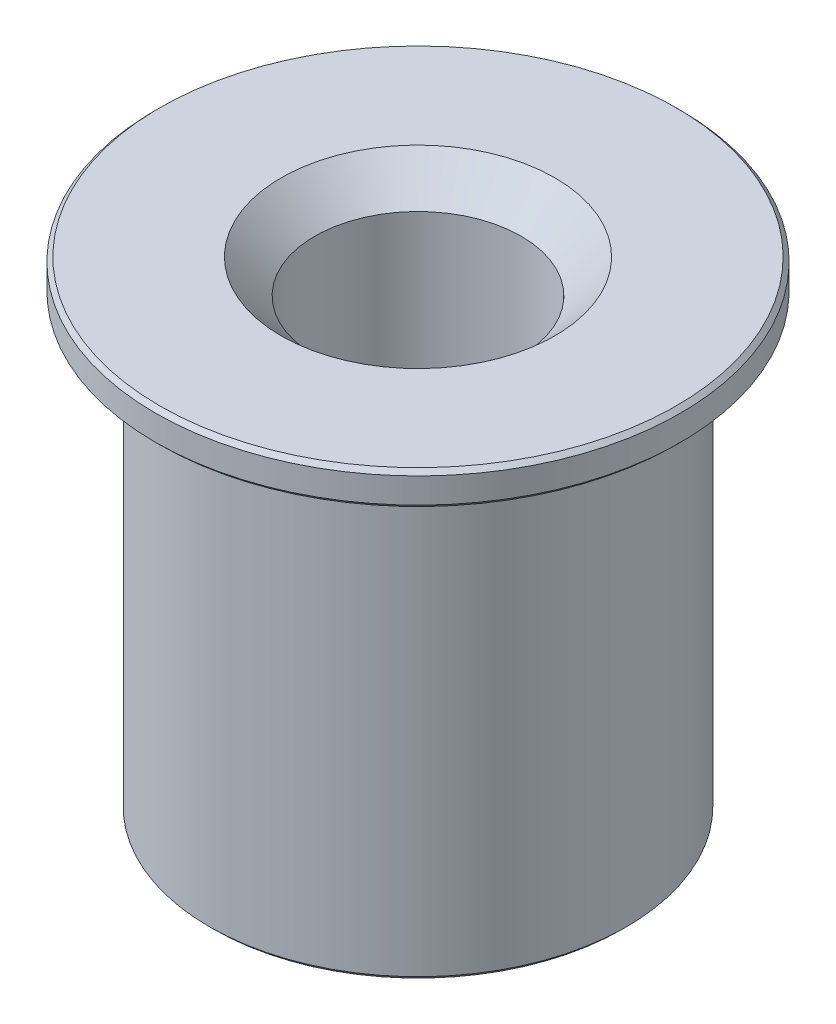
ISO-10303-21;
HEADER;
FILE_DESCRIPTION(('STEP AP214'),'2;1');
FILE_NAME('part.step','',(''),(''),'','','');
FILE_SCHEMA(('AUTOMOTIVE_DESIGN { 1 0 10303 214 1 1 1 1 }'));
ENDSEC;
DATA;
#1=APPLICATION_CONTEXT('core data for automotive mechanical design processes');
#2=APPLICATION_PROTOCOL_DEFINITION('international standard','automotive_design',2000,#1);
#3=PRODUCT_CONTEXT('',#1,'mechanical');
#4=PRODUCT('Part','Part','',(#3));
#5=PRODUCT_RELATED_PRODUCT_CATEGORY('part','',(#4));
#6=PRODUCT_DEFINITION_FORMATION('','',#4);
#7=PRODUCT_DEFINITION_CONTEXT('part definition',#1,'design');
#8=PRODUCT_DEFINITION('design','',#6,#7);
#9=PRODUCT_DEFINITION_SHAPE('','',#8);
#10=(LENGTH_UNIT() NAMED_UNIT(*) SI_UNIT(.MILLI.,.METRE.));
#11=(NAMED_UNIT(*) PLANE_ANGLE_UNIT() SI_UNIT($,.RADIAN.));
#12=(NAMED_UNIT(*) SI_UNIT($,.STERADIAN.) SOLID_ANGLE_UNIT());
#13=UNCERTAINTY_MEASURE_WITH_UNIT(LENGTH_MEASURE(1.E-05),#10,'distance_accuracy_value','');
#14=(GEOMETRIC_REPRESENTATION_CONTEXT(3) GLOBAL_UNCERTAINTY_ASSIGNED_CONTEXT((#13)) GLOBAL_UNIT_ASSIGNED_CONTEXT((#10,
#11,#12)) REPRESENTATION_CONTEXT('',''));
#15=CARTESIAN_POINT('',(0.,0.,0.));
#16=DIRECTION('',(0.,0.,1.));
#17=DIRECTION('',(1.,0.,0.));
#18=AXIS2_PLACEMENT_3D('',#15,#16,#17);
#19=CARTESIAN_POINT('',(0.,14.478,0.));
#20=DIRECTION('',(0.,-1.,0.));
#21=DIRECTION('',(0.,0.,-1.));
#22=AXIS2_PLACEMENT_3D('',#19,#20,#21);
#23=CYLINDRICAL_SURFACE('',#22,6.2865);
#24=CARTESIAN_POINT('',(0.,0.127000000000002,0.));
#25=DIRECTION('',(0.,1.,0.));
#26=DIRECTION('',(0.,0.,1.));
#27=AXIS2_PLACEMENT_3D('',#24,#25,#26);
#28=CIRCLE('',#27,6.2865);
#29=CARTESIAN_POINT('',(0.,0.127000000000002,6.2865));
#30=VERTEX_POINT('',#29);
#31=EDGE_CURVE('E46',#30,#30,#28,.T.);
#32=ORIENTED_EDGE('',*,*,#31,.T.);
#33=EDGE_LOOP('',(#32));
#34=FACE_BOUND('',#33,.T.);
#35=CARTESIAN_POINT('',(0.,13.335,0.));
#36=DIRECTION('',(0.,1.,0.));
#37=DIRECTION('',(0.,0.,1.));
#38=AXIS2_PLACEMENT_3D('',#35,#36,#37);
#39=CIRCLE('',#38,6.2865);
#40=CARTESIAN_POINT('',(0.,13.335,6.2865));
#41=VERTEX_POINT('',#40);
#42=EDGE_CURVE('E49',#41,#41,#39,.F.);
#43=ORIENTED_EDGE('',*,*,#42,.T.);
#44=EDGE_LOOP('',(#43));
#45=FACE_BOUND('',#44,.T.);
#46=ADVANCED_FACE('F24',(#34,#45),#23,.T.);
#47=CARTESIAN_POINT('',(0.,14.478,0.));
#48=DIRECTION('',(0.,1.,0.));
#49=DIRECTION('',(0.,0.,1.));
#50=AXIS2_PLACEMENT_3D('',#47,#48,#49);
#51=PLANE('',#50);
#52=CARTESIAN_POINT('',(0.,14.478,0.));
#53=DIRECTION('',(0.,1.,0.));
#54=DIRECTION('',(0.,0.,1.));
#55=AXIS2_PLACEMENT_3D('',#52,#53,#54);
#56=CIRCLE('',#55,7.7851);
#57=CARTESIAN_POINT('',(0.,14.478,7.7851));
#58=VERTEX_POINT('',#57);
#59=EDGE_CURVE('E10',#58,#58,#56,.T.);
#60=ORIENTED_EDGE('',*,*,#59,.T.);
#61=EDGE_LOOP('',(#60));
#62=FACE_BOUND('',#61,.T.);
#63=CARTESIAN_POINT('',(0.,14.478,0.));
#64=DIRECTION('',(0.,1.,0.));
#65=DIRECTION('',(0.,0.,1.));
#66=AXIS2_PLACEMENT_3D('',#63,#64,#65);
#67=CIRCLE('',#66,4.1275);
#68=CARTESIAN_POINT('',(0.,14.478,4.1275));
#69=VERTEX_POINT('',#68);
#70=EDGE_CURVE('E61',#69,#69,#67,.F.);
#71=ORIENTED_EDGE('',*,*,#70,.T.);
#72=EDGE_LOOP('',(#71));
#73=FACE_BOUND('',#72,.T.);
#74=ADVANCED_FACE('F88',(#62,#73),#51,.T.);
#75=CARTESIAN_POINT('',(0.,0.,0.));
#76=DIRECTION('',(0.,1.,0.));
#77=DIRECTION('',(0.,0.,1.));
#78=AXIS2_PLACEMENT_3D('',#75,#76,#77);
#79=PLANE('',#78);
#80=CARTESIAN_POINT('',(0.,0.,0.));
#81=DIRECTION('',(0.,1.,0.));
#82=DIRECTION('',(0.,0.,1.));
#83=AXIS2_PLACEMENT_3D('',#80,#81,#82);
#84=CIRCLE('',#83,3.2385);
#85=CARTESIAN_POINT('',(0.,0.,3.2385));
#86=VERTEX_POINT('',#85);
#87=EDGE_CURVE('E55',#86,#86,#84,.T.);
#88=ORIENTED_EDGE('',*,*,#87,.T.);
#89=EDGE_LOOP('',(#88));
#90=FACE_BOUND('',#89,.T.);
#91=CARTESIAN_POINT('',(0.,0.,0.));
#92=DIRECTION('',(0.,1.,0.));
#93=DIRECTION('',(0.,0.,1.));
#94=AXIS2_PLACEMENT_3D('',#91,#92,#93);
#95=CIRCLE('',#94,6.1595);
#96=CARTESIAN_POINT('',(0.,0.,6.1595));
#97=VERTEX_POINT('',#96);
#98=EDGE_CURVE('E58',#97,#97,#95,.F.);
#99=ORIENTED_EDGE('',*,*,#98,.T.);
#100=EDGE_LOOP('',(#99));
#101=FACE_BOUND('',#100,.T.);
#102=ADVANCED_FACE('F93',(#90,#101),#79,.F.);
#103=CARTESIAN_POINT('',(0.,14.478,0.));
#104=DIRECTION('',(0.,-1.,0.));
#105=DIRECTION('',(0.,0.,-1.));
#106=AXIS2_PLACEMENT_3D('',#103,#104,#105);
#107=CYLINDRICAL_SURFACE('',#106,3.1115);
#108=CARTESIAN_POINT('',(0.,0.127,0.));
#109=DIRECTION('',(0.,1.,0.));
#110=DIRECTION('',(0.,0.,1.));
#111=AXIS2_PLACEMENT_3D('',#108,#109,#110);
#112=CIRCLE('',#111,3.1115);
#113=CARTESIAN_POINT('',(0.,0.127,3.1115));
#114=VERTEX_POINT('',#113);
#115=EDGE_CURVE('E52',#114,#114,#112,.F.);
#116=ORIENTED_EDGE('',*,*,#115,.T.);
#117=EDGE_LOOP('',(#116));
#118=FACE_BOUND('',#117,.T.);
#119=CARTESIAN_POINT('',(0.,13.462,0.));
#120=DIRECTION('',(0.,1.,0.));
#121=DIRECTION('',(0.,0.,1.));
#122=AXIS2_PLACEMENT_3D('',#119,#120,#121);
#123=CIRCLE('',#122,3.1115);
#124=CARTESIAN_POINT('',(0.,13.462,3.1115));
#125=VERTEX_POINT('',#124);
#126=EDGE_CURVE('E64',#125,#125,#123,.T.);
#127=ORIENTED_EDGE('',*,*,#126,.T.);
#128=EDGE_LOOP('',(#127));
#129=FACE_BOUND('',#128,.T.);
#130=ADVANCED_FACE('F68',(#118,#129),#107,.F.);
#131=CARTESIAN_POINT('',(0.,13.462,0.));
#132=DIRECTION('',(0.,1.,0.));
#133=DIRECTION('',(0.,0.,1.));
#134=AXIS2_PLACEMENT_3D('',#131,#132,#133);
#135=PLANE('',#134);
#136=CARTESIAN_POINT('',(0.,13.462,0.));
#137=DIRECTION('',(0.,1.,0.));
#138=DIRECTION('',(0.,0.,1.));
#139=AXIS2_PLACEMENT_3D('',#136,#137,#138);
#140=CIRCLE('',#139,6.4135);
#141=CARTESIAN_POINT('',(0.,13.462,6.4135));
#142=VERTEX_POINT('',#141);
#143=EDGE_CURVE('E38',#142,#142,#140,.T.);
#144=ORIENTED_EDGE('',*,*,#143,.T.);
#145=EDGE_LOOP('',(#144));
#146=FACE_BOUND('',#145,.T.);
#147=CARTESIAN_POINT('',(0.,13.462,0.));
#148=DIRECTION('',(0.,1.,0.));
#149=DIRECTION('',(0.,0.,1.));
#150=AXIS2_PLACEMENT_3D('',#147,#148,#149);
#151=CIRCLE('',#150,7.7851);
#152=CARTESIAN_POINT('',(0.,13.462,7.7851));
#153=VERTEX_POINT('',#152);
#154=EDGE_CURVE('E43',#153,#153,#151,.F.);
#155=ORIENTED_EDGE('',*,*,#154,.T.);
#156=EDGE_LOOP('',(#155));
#157=FACE_BOUND('',#156,.T.);
#158=ADVANCED_FACE('F84',(#146,#157),#135,.F.);
#159=CARTESIAN_POINT('',(0.,13.462,0.));
#160=DIRECTION('',(0.,1.,0.));
#161=DIRECTION('',(0.,0.,1.));
#162=AXIS2_PLACEMENT_3D('',#159,#160,#161);
#163=CYLINDRICAL_SURFACE('',#162,7.9121);
#164=CARTESIAN_POINT('',(0.,13.589,0.));
#165=DIRECTION('',(0.,1.,0.));
#166=DIRECTION('',(0.,0.,1.));
#167=AXIS2_PLACEMENT_3D('',#164,#165,#166);
#168=CIRCLE('',#167,7.9121);
#169=CARTESIAN_POINT('',(0.,13.589,7.9121));
#170=VERTEX_POINT('',#169);
#171=EDGE_CURVE('E30',#170,#170,#168,.T.);
#172=ORIENTED_EDGE('',*,*,#171,.T.);
#173=EDGE_LOOP('',(#172));
#174=FACE_BOUND('',#173,.T.);
#175=CARTESIAN_POINT('',(0.,14.351,0.));
#176=DIRECTION('',(0.,1.,0.));
#177=DIRECTION('',(0.,0.,1.));
#178=AXIS2_PLACEMENT_3D('',#175,#176,#177);
#179=CIRCLE('',#178,7.9121);
#180=CARTESIAN_POINT('',(0.,14.351,7.9121));
#181=VERTEX_POINT('',#180);
#182=EDGE_CURVE('E34',#181,#181,#179,.F.);
#183=ORIENTED_EDGE('',*,*,#182,.T.);
#184=EDGE_LOOP('',(#183));
#185=FACE_BOUND('',#184,.T.);
#186=ADVANCED_FACE('F73',(#174,#185),#163,.T.);
#187=CARTESIAN_POINT('',(0.,13.462,0.));
#188=DIRECTION('',(0.,1.,0.));
#189=DIRECTION('',(0.,0.,1.));
#190=AXIS2_PLACEMENT_3D('',#187,#188,#189);
#191=CONICAL_SURFACE('',#190,3.1115,0.78539816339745);
#192=ORIENTED_EDGE('',*,*,#70,.F.);
#193=EDGE_LOOP('',(#192));
#194=FACE_BOUND('',#193,.T.);
#195=ORIENTED_EDGE('',*,*,#126,.F.);
#196=EDGE_LOOP('',(#195));
#197=FACE_BOUND('',#196,.T.);
#198=ADVANCED_FACE('F70',(#194,#197),#191,.F.);
#199=CARTESIAN_POINT('',(0.,0.,0.));
#200=DIRECTION('',(0.,-1.,0.));
#201=DIRECTION('',(0.,0.,-1.));
#202=AXIS2_PLACEMENT_3D('',#199,#200,#201);
#203=CONICAL_SURFACE('',#202,3.2385,0.785398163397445);
#204=ORIENTED_EDGE('',*,*,#115,.F.);
#205=EDGE_LOOP('',(#204));
#206=FACE_BOUND('',#205,.T.);
#207=ORIENTED_EDGE('',*,*,#87,.F.);
#208=EDGE_LOOP('',(#207));
#209=FACE_BOUND('',#208,.T.);
#210=ADVANCED_FACE('F72',(#206,#209),#203,.F.);
#211=CARTESIAN_POINT('',(0.,0.127000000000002,0.));
#212=DIRECTION('',(0.,1.,0.));
#213=DIRECTION('',(0.,0.,1.));
#214=AXIS2_PLACEMENT_3D('',#211,#212,#213);
#215=CONICAL_SURFACE('',#214,6.2865,0.785398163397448);
#216=ORIENTED_EDGE('',*,*,#98,.F.);
#217=EDGE_LOOP('',(#216));
#218=FACE_BOUND('',#217,.T.);
#219=ORIENTED_EDGE('',*,*,#31,.F.);
#220=EDGE_LOOP('',(#219));
#221=FACE_BOUND('',#220,.T.);
#222=ADVANCED_FACE('F80',(#218,#221),#215,.T.);
#223=CARTESIAN_POINT('',(0.,13.462,0.));
#224=DIRECTION('',(0.,1.,0.));
#225=DIRECTION('',(0.,0.,1.));
#226=AXIS2_PLACEMENT_3D('',#223,#224,#225);
#227=CONICAL_SURFACE('',#226,6.4135,0.785398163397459);
#228=ORIENTED_EDGE('',*,*,#42,.F.);
#229=EDGE_LOOP('',(#228));
#230=FACE_BOUND('',#229,.T.);
#231=ORIENTED_EDGE('',*,*,#143,.F.);
#232=EDGE_LOOP('',(#231));
#233=FACE_BOUND('',#232,.T.);
#234=ADVANCED_FACE('F98',(#230,#233),#227,.T.);
#235=CARTESIAN_POINT('',(0.,13.589,0.));
#236=DIRECTION('',(0.,1.,0.));
#237=DIRECTION('',(0.,0.,1.));
#238=AXIS2_PLACEMENT_3D('',#235,#236,#237);
#239=CONICAL_SURFACE('',#238,7.9121,0.785398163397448);
#240=ORIENTED_EDGE('',*,*,#154,.F.);
#241=EDGE_LOOP('',(#240));
#242=FACE_BOUND('',#241,.T.);
#243=ORIENTED_EDGE('',*,*,#171,.F.);
#244=EDGE_LOOP('',(#243));
#245=FACE_BOUND('',#244,.T.);
#246=ADVANCED_FACE('F101',(#242,#245),#239,.T.);
#247=CARTESIAN_POINT('',(0.,14.478,0.));
#248=DIRECTION('',(0.,-1.,0.));
#249=DIRECTION('',(0.,0.,-1.));
#250=AXIS2_PLACEMENT_3D('',#247,#248,#249);
#251=CONICAL_SURFACE('',#250,7.7851,0.785398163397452);
#252=ORIENTED_EDGE('',*,*,#182,.F.);
#253=EDGE_LOOP('',(#252));
#254=FACE_BOUND('',#253,.T.);
#255=ORIENTED_EDGE('',*,*,#59,.F.);
#256=EDGE_LOOP('',(#255));
#257=FACE_BOUND('',#256,.T.);
#258=ADVANCED_FACE('F111',(#254,#257),#251,.T.);
#259=CLOSED_SHELL('',(#46,#74,#102,#130,#158,#186,#198,#210,#222,#234,#246,#258));
#260=MANIFOLD_SOLID_BREP('B2',#259);
#261=ADVANCED_BREP_SHAPE_REPRESENTATION('',(#18,#260),#14);
#262=SHAPE_DEFINITION_REPRESENTATION(#9,#261);
ENDSEC;
END-ISO-10303-21;
